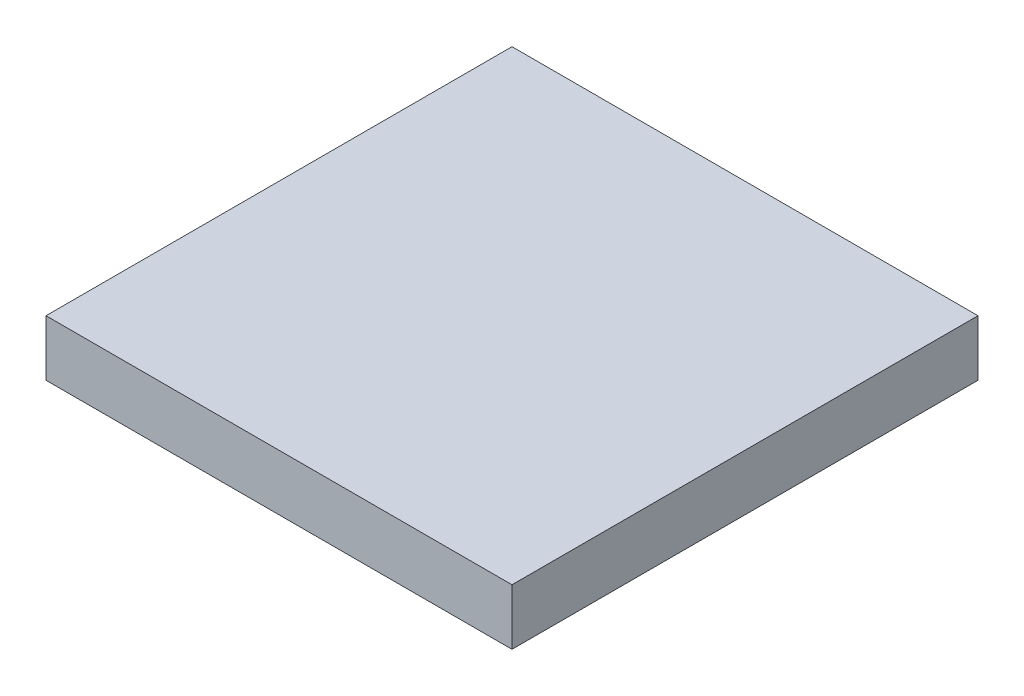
ISO-10303-21;
HEADER;
FILE_DESCRIPTION(('STEP AP214'),'2;1');
FILE_NAME('part.step','',(''),(''),'','','');
FILE_SCHEMA(('AUTOMOTIVE_DESIGN { 1 0 10303 214 1 1 1 1 }'));
ENDSEC;
DATA;
#1=APPLICATION_CONTEXT('core data for automotive mechanical design processes');
#2=APPLICATION_PROTOCOL_DEFINITION('international standard','automotive_design',2000,#1);
#3=PRODUCT_CONTEXT('',#1,'mechanical');
#4=PRODUCT('Part','Part','',(#3));
#5=PRODUCT_RELATED_PRODUCT_CATEGORY('part','',(#4));
#6=PRODUCT_DEFINITION_FORMATION('','',#4);
#7=PRODUCT_DEFINITION_CONTEXT('part definition',#1,'design');
#8=PRODUCT_DEFINITION('design','',#6,#7);
#9=PRODUCT_DEFINITION_SHAPE('','',#8);
#10=(LENGTH_UNIT() NAMED_UNIT(*) SI_UNIT(.MILLI.,.METRE.));
#11=(NAMED_UNIT(*) PLANE_ANGLE_UNIT() SI_UNIT($,.RADIAN.));
#12=(NAMED_UNIT(*) SI_UNIT($,.STERADIAN.) SOLID_ANGLE_UNIT());
#13=UNCERTAINTY_MEASURE_WITH_UNIT(LENGTH_MEASURE(1.E-05),#10,'distance_accuracy_value','');
#14=(GEOMETRIC_REPRESENTATION_CONTEXT(3) GLOBAL_UNCERTAINTY_ASSIGNED_CONTEXT((#13)) GLOBAL_UNIT_ASSIGNED_CONTEXT((#10,
#11,#12)) REPRESENTATION_CONTEXT('',''));
#15=CARTESIAN_POINT('',(0.,0.,0.));
#16=DIRECTION('',(0.,0.,1.));
#17=DIRECTION('',(1.,0.,0.));
#18=AXIS2_PLACEMENT_3D('',#15,#16,#17);
#19=CARTESIAN_POINT('',(0.,12.,0.));
#20=DIRECTION('',(1.,0.,0.));
#21=DIRECTION('',(0.,0.,-1.));
#22=AXIS2_PLACEMENT_3D('',#19,#20,#21);
#23=PLANE('',#22);
#24=DIRECTION('',(0.,0.,1.));
#25=VECTOR('',#24,1.);
#26=CARTESIAN_POINT('',(0.,0.,0.));
#27=LINE('',#26,#25);
#28=CARTESIAN_POINT('',(0.,0.,-100.));
#29=VERTEX_POINT('',#28);
#30=CARTESIAN_POINT('',(0.,0.,0.));
#31=VERTEX_POINT('',#30);
#32=EDGE_CURVE('E107',#29,#31,#27,.T.);
#33=ORIENTED_EDGE('',*,*,#32,.T.);
#34=DIRECTION('',(0.,-1.,0.));
#35=VECTOR('',#34,1.);
#36=CARTESIAN_POINT('',(0.,12.,0.));
#37=LINE('',#36,#35);
#38=CARTESIAN_POINT('',(0.,12.,0.));
#39=VERTEX_POINT('',#38);
#40=EDGE_CURVE('E11',#39,#31,#37,.T.);
#41=ORIENTED_EDGE('',*,*,#40,.F.);
#42=DIRECTION('',(0.,0.,1.));
#43=VECTOR('',#42,1.);
#44=CARTESIAN_POINT('',(0.,12.,0.));
#45=LINE('',#44,#43);
#46=CARTESIAN_POINT('',(0.,12.,-100.));
#47=VERTEX_POINT('',#46);
#48=EDGE_CURVE('E91',#47,#39,#45,.T.);
#49=ORIENTED_EDGE('',*,*,#48,.F.);
#50=DIRECTION('',(0.,-1.,0.));
#51=VECTOR('',#50,1.);
#52=CARTESIAN_POINT('',(0.,12.,-100.));
#53=LINE('',#52,#51);
#54=EDGE_CURVE('E103',#47,#29,#53,.T.);
#55=ORIENTED_EDGE('',*,*,#54,.T.);
#56=EDGE_LOOP('',(#33,#41,#49,#55));
#57=FACE_BOUND('',#56,.T.);
#58=ADVANCED_FACE('F39',(#57),#23,.F.);
#59=CARTESIAN_POINT('',(0.,12.,0.));
#60=DIRECTION('',(0.,0.,-1.));
#61=DIRECTION('',(-1.,0.,0.));
#62=AXIS2_PLACEMENT_3D('',#59,#60,#61);
#63=PLANE('',#62);
#64=DIRECTION('',(1.,0.,0.));
#65=VECTOR('',#64,1.);
#66=CARTESIAN_POINT('',(0.,0.,0.));
#67=LINE('',#66,#65);
#68=CARTESIAN_POINT('',(100.,0.,0.));
#69=VERTEX_POINT('',#68);
#70=EDGE_CURVE('E96',#31,#69,#67,.T.);
#71=ORIENTED_EDGE('',*,*,#70,.T.);
#72=DIRECTION('',(0.,-1.,0.));
#73=VECTOR('',#72,1.);
#74=CARTESIAN_POINT('',(100.,12.,0.));
#75=LINE('',#74,#73);
#76=CARTESIAN_POINT('',(100.,12.,0.));
#77=VERTEX_POINT('',#76);
#78=EDGE_CURVE('E48',#77,#69,#75,.T.);
#79=ORIENTED_EDGE('',*,*,#78,.F.);
#80=DIRECTION('',(1.,0.,0.));
#81=VECTOR('',#80,1.);
#82=CARTESIAN_POINT('',(0.,12.,0.));
#83=LINE('',#82,#81);
#84=EDGE_CURVE('E86',#39,#77,#83,.T.);
#85=ORIENTED_EDGE('',*,*,#84,.F.);
#86=ORIENTED_EDGE('',*,*,#40,.T.);
#87=EDGE_LOOP('',(#71,#79,#85,#86));
#88=FACE_BOUND('',#87,.T.);
#89=ADVANCED_FACE('F95',(#88),#63,.F.);
#90=CARTESIAN_POINT('',(100.,12.,0.));
#91=DIRECTION('',(-1.,0.,0.));
#92=DIRECTION('',(0.,0.,1.));
#93=AXIS2_PLACEMENT_3D('',#90,#91,#92);
#94=PLANE('',#93);
#95=DIRECTION('',(0.,0.,-1.));
#96=VECTOR('',#95,1.);
#97=CARTESIAN_POINT('',(100.,0.,0.));
#98=LINE('',#97,#96);
#99=CARTESIAN_POINT('',(100.,0.,-100.));
#100=VERTEX_POINT('',#99);
#101=EDGE_CURVE('E73',#69,#100,#98,.T.);
#102=ORIENTED_EDGE('',*,*,#101,.T.);
#103=DIRECTION('',(0.,-1.,0.));
#104=VECTOR('',#103,1.);
#105=CARTESIAN_POINT('',(100.,12.,-100.));
#106=LINE('',#105,#104);
#107=CARTESIAN_POINT('',(100.,12.,-100.));
#108=VERTEX_POINT('',#107);
#109=EDGE_CURVE('E98',#108,#100,#106,.T.);
#110=ORIENTED_EDGE('',*,*,#109,.F.);
#111=DIRECTION('',(0.,0.,-1.));
#112=VECTOR('',#111,1.);
#113=CARTESIAN_POINT('',(100.,12.,0.));
#114=LINE('',#113,#112);
#115=EDGE_CURVE('E89',#77,#108,#114,.T.);
#116=ORIENTED_EDGE('',*,*,#115,.F.);
#117=ORIENTED_EDGE('',*,*,#78,.T.);
#118=EDGE_LOOP('',(#102,#110,#116,#117));
#119=FACE_BOUND('',#118,.T.);
#120=ADVANCED_FACE('F99',(#119),#94,.F.);
#121=CARTESIAN_POINT('',(0.,12.,-100.));
#122=DIRECTION('',(0.,0.,1.));
#123=DIRECTION('',(1.,0.,0.));
#124=AXIS2_PLACEMENT_3D('',#121,#122,#123);
#125=PLANE('',#124);
#126=DIRECTION('',(-1.,0.,0.));
#127=VECTOR('',#126,1.);
#128=CARTESIAN_POINT('',(0.,0.,-100.));
#129=LINE('',#128,#127);
#130=EDGE_CURVE('E79',#100,#29,#129,.T.);
#131=ORIENTED_EDGE('',*,*,#130,.T.);
#132=ORIENTED_EDGE('',*,*,#54,.F.);
#133=DIRECTION('',(-1.,0.,0.));
#134=VECTOR('',#133,1.);
#135=CARTESIAN_POINT('',(0.,12.,-100.));
#136=LINE('',#135,#134);
#137=EDGE_CURVE('E56',#108,#47,#136,.T.);
#138=ORIENTED_EDGE('',*,*,#137,.F.);
#139=ORIENTED_EDGE('',*,*,#109,.T.);
#140=EDGE_LOOP('',(#131,#132,#138,#139));
#141=FACE_BOUND('',#140,.T.);
#142=ADVANCED_FACE('F120',(#141),#125,.F.);
#143=CARTESIAN_POINT('',(0.,12.,0.));
#144=DIRECTION('',(0.,-1.,0.));
#145=DIRECTION('',(0.,0.,-1.));
#146=AXIS2_PLACEMENT_3D('',#143,#144,#145);
#147=PLANE('',#146);
#148=ORIENTED_EDGE('',*,*,#48,.T.);
#149=ORIENTED_EDGE('',*,*,#84,.T.);
#150=ORIENTED_EDGE('',*,*,#115,.T.);
#151=ORIENTED_EDGE('',*,*,#137,.T.);
#152=EDGE_LOOP('',(#148,#149,#150,#151));
#153=FACE_BOUND('',#152,.T.);
#154=ADVANCED_FACE('F87',(#153),#147,.F.);
#155=CARTESIAN_POINT('',(0.,0.,0.));
#156=DIRECTION('',(0.,-1.,0.));
#157=DIRECTION('',(0.,0.,-1.));
#158=AXIS2_PLACEMENT_3D('',#155,#156,#157);
#159=PLANE('',#158);
#160=ORIENTED_EDGE('',*,*,#32,.F.);
#161=ORIENTED_EDGE('',*,*,#130,.F.);
#162=ORIENTED_EDGE('',*,*,#101,.F.);
#163=ORIENTED_EDGE('',*,*,#70,.F.);
#164=EDGE_LOOP('',(#160,#161,#162,#163));
#165=FACE_BOUND('',#164,.T.);
#166=ADVANCED_FACE('F123',(#165),#159,.T.);
#167=CLOSED_SHELL('',(#58,#89,#120,#142,#154,#166));
#168=MANIFOLD_SOLID_BREP('B2',#167);
#169=ADVANCED_BREP_SHAPE_REPRESENTATION('',(#18,#168),#14);
#170=SHAPE_DEFINITION_REPRESENTATION(#9,#169);
ENDSEC;
END-ISO-10303-21;
